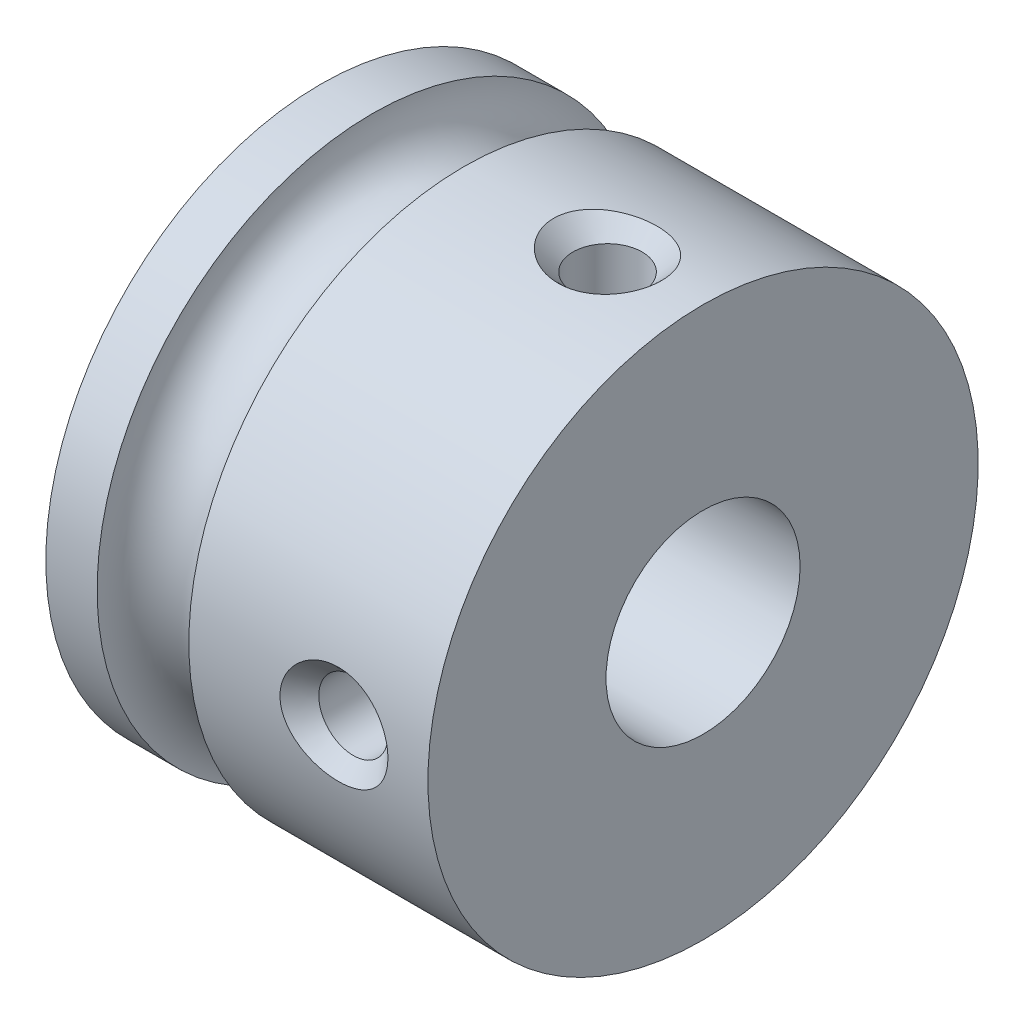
ISO-10303-21;
HEADER;
FILE_DESCRIPTION(('STEP AP214'),'2;1');
FILE_NAME('part.step','',(''),(''),'','','');
FILE_SCHEMA(('AUTOMOTIVE_DESIGN { 1 0 10303 214 1 1 1 1 }'));
ENDSEC;
DATA;
#1=APPLICATION_CONTEXT('core data for automotive mechanical design processes');
#2=APPLICATION_PROTOCOL_DEFINITION('international standard','automotive_design',2000,#1);
#3=PRODUCT_CONTEXT('',#1,'mechanical');
#4=PRODUCT('Part','Part','',(#3));
#5=PRODUCT_RELATED_PRODUCT_CATEGORY('part','',(#4));
#6=PRODUCT_DEFINITION_FORMATION('','',#4);
#7=PRODUCT_DEFINITION_CONTEXT('part definition',#1,'design');
#8=PRODUCT_DEFINITION('design','',#6,#7);
#9=PRODUCT_DEFINITION_SHAPE('','',#8);
#10=(LENGTH_UNIT() NAMED_UNIT(*) SI_UNIT(.MILLI.,.METRE.));
#11=(NAMED_UNIT(*) PLANE_ANGLE_UNIT() SI_UNIT($,.RADIAN.));
#12=(NAMED_UNIT(*) SI_UNIT($,.STERADIAN.) SOLID_ANGLE_UNIT());
#13=UNCERTAINTY_MEASURE_WITH_UNIT(LENGTH_MEASURE(1.E-05),#10,'distance_accuracy_value','');
#14=(GEOMETRIC_REPRESENTATION_CONTEXT(3) GLOBAL_UNCERTAINTY_ASSIGNED_CONTEXT((#13)) GLOBAL_UNIT_ASSIGNED_CONTEXT((#10,
#11,#12)) REPRESENTATION_CONTEXT('',''));
#15=CARTESIAN_POINT('',(0.,0.,0.));
#16=DIRECTION('',(0.,0.,1.));
#17=DIRECTION('',(1.,0.,0.));
#18=AXIS2_PLACEMENT_3D('',#15,#16,#17);
#19=CARTESIAN_POINT('',(-6.25000000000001,9.00000000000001,0.));
#20=DIRECTION('',(1.,0.,0.));
#21=DIRECTION('',(0.,1.,0.));
#22=AXIS2_PLACEMENT_3D('',#19,#20,#21);
#23=PLANE('',#22);
#24=CARTESIAN_POINT('',(-6.25000000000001,0.,0.));
#25=DIRECTION('',(1.,0.,0.));
#26=DIRECTION('',(0.,0.,-1.));
#27=AXIS2_PLACEMENT_3D('',#24,#25,#26);
#28=CIRCLE('',#27,3.175);
#29=CARTESIAN_POINT('',(-6.25000000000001,0.,-3.175));
#30=VERTEX_POINT('',#29);
#31=EDGE_CURVE('E108',#30,#30,#28,.T.);
#32=ORIENTED_EDGE('',*,*,#31,.T.);
#33=EDGE_LOOP('',(#32));
#34=FACE_BOUND('',#33,.T.);
#35=CARTESIAN_POINT('',(-6.25000000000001,0.,0.));
#36=DIRECTION('',(-1.,0.,0.));
#37=DIRECTION('',(0.,-1.,0.));
#38=AXIS2_PLACEMENT_3D('',#35,#36,#37);
#39=CIRCLE('',#38,8.99999999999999);
#40=CARTESIAN_POINT('',(-6.25,-9.,0.));
#41=VERTEX_POINT('',#40);
#42=EDGE_CURVE('E111',#41,#41,#39,.T.);
#43=ORIENTED_EDGE('',*,*,#42,.T.);
#44=EDGE_LOOP('',(#43));
#45=FACE_BOUND('',#44,.T.);
#46=ADVANCED_FACE('F32',(#34,#45),#23,.F.);
#47=CARTESIAN_POINT('',(6.24999999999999,9.00000000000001,0.));
#48=DIRECTION('',(-1.,0.,0.));
#49=DIRECTION('',(0.,-1.,0.));
#50=AXIS2_PLACEMENT_3D('',#47,#48,#49);
#51=PLANE('',#50);
#52=CARTESIAN_POINT('',(6.25000000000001,0.,0.));
#53=DIRECTION('',(1.,0.,0.));
#54=DIRECTION('',(0.,0.,-1.));
#55=AXIS2_PLACEMENT_3D('',#52,#53,#54);
#56=CIRCLE('',#55,3.175);
#57=CARTESIAN_POINT('',(6.25000000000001,0.,-3.175));
#58=VERTEX_POINT('',#57);
#59=EDGE_CURVE('E78',#58,#58,#56,.T.);
#60=ORIENTED_EDGE('',*,*,#59,.F.);
#61=EDGE_LOOP('',(#60));
#62=FACE_BOUND('',#61,.T.);
#63=CARTESIAN_POINT('',(6.24999999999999,0.,0.));
#64=DIRECTION('',(-1.,0.,0.));
#65=DIRECTION('',(0.,-1.,0.));
#66=AXIS2_PLACEMENT_3D('',#63,#64,#65);
#67=CIRCLE('',#66,8.99999999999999);
#68=CARTESIAN_POINT('',(6.24999999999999,-9.,0.));
#69=VERTEX_POINT('',#68);
#70=EDGE_CURVE('E47',#69,#69,#67,.T.);
#71=ORIENTED_EDGE('',*,*,#70,.F.);
#72=EDGE_LOOP('',(#71));
#73=FACE_BOUND('',#72,.T.);
#74=ADVANCED_FACE('F96',(#62,#73),#51,.F.);
#75=CARTESIAN_POINT('',(-27.9821883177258,0.,0.));
#76=DIRECTION('',(-1.,0.,0.));
#77=DIRECTION('',(0.,-1.,0.));
#78=AXIS2_PLACEMENT_3D('',#75,#76,#77);
#79=CYLINDRICAL_SURFACE('',#78,8.99999999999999);
#80=CARTESIAN_POINT('',(1.97285696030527,-1.183727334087,8.92181537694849));
#81=CARTESIAN_POINT('',(1.90953795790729,-1.12965014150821,8.92898979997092));
#82=CARTESIAN_POINT('',(1.85015079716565,-1.07098631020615,8.93627361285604));
#83=CARTESIAN_POINT('',(1.74079627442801,-0.945354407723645,8.95043570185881));
#84=CARTESIAN_POINT('',(1.69083126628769,-0.878384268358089,8.95731387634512));
#85=CARTESIAN_POINT('',(1.59632303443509,-0.728460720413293,8.97082390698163));
#86=CARTESIAN_POINT('',(1.55325107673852,-0.644556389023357,8.97731609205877));
#87=CARTESIAN_POINT('',(1.48316524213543,-0.470137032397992,8.9881357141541));
#88=CARTESIAN_POINT('',(1.45614708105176,-0.379623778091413,8.99246372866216));
#89=CARTESIAN_POINT('',(1.42117367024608,-0.202819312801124,8.99811211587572));
#90=CARTESIAN_POINT('',(1.41180582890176,-0.116813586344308,8.99965489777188));
#91=CARTESIAN_POINT('',(1.40823099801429,0.055502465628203,9.0002406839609));
#92=CARTESIAN_POINT('',(1.41401829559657,0.141812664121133,8.99928463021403));
#93=CARTESIAN_POINT('',(1.4398243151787,0.308043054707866,8.99509350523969));
#94=CARTESIAN_POINT('',(1.45916328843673,0.388073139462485,8.99196735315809));
#95=CARTESIAN_POINT('',(1.51048777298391,0.543857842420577,8.98389158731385));
#96=CARTESIAN_POINT('',(1.54247455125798,0.619612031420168,8.97894179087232));
#97=CARTESIAN_POINT('',(1.6189874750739,0.767256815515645,8.96755090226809));
#98=CARTESIAN_POINT('',(1.66386005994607,0.83896407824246,8.9610696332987));
#99=CARTESIAN_POINT('',(1.7641265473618,0.974503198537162,8.94734560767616));
#100=CARTESIAN_POINT('',(1.81952373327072,1.03833258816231,8.94010261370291));
#101=CARTESIAN_POINT('',(1.94405674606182,1.16184337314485,8.92492608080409));
#102=CARTESIAN_POINT('',(2.01394302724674,1.2207666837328,8.91698423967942));
#103=CARTESIAN_POINT('',(2.1620245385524,1.32713340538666,8.90177568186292));
#104=CARTESIAN_POINT('',(2.24022283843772,1.37457255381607,8.89450921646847));
#105=CARTESIAN_POINT('',(2.40977641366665,1.46073726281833,8.8807835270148));
#106=CARTESIAN_POINT('',(2.5016851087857,1.49839488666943,8.87444353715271));
#107=CARTESIAN_POINT('',(2.69041111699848,1.55875600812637,8.86404085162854));
#108=CARTESIAN_POINT('',(2.78722970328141,1.58145560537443,8.8599787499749));
#109=CARTESIAN_POINT('',(2.98830005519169,1.61229357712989,8.8544212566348));
#110=CARTESIAN_POINT('',(3.09267928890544,1.61963168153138,8.85306708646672));
#111=CARTESIAN_POINT('',(3.30124314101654,1.61724124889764,8.85350383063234));
#112=CARTESIAN_POINT('',(3.405427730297,1.60751033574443,8.85529518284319));
#113=CARTESIAN_POINT('',(3.61221947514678,1.57088576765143,8.86186593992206));
#114=CARTESIAN_POINT('',(3.71478159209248,1.54374434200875,8.86668846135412));
#115=CARTESIAN_POINT('',(3.91373558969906,1.47255635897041,8.87878786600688));
#116=CARTESIAN_POINT('',(4.01012703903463,1.42850862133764,8.88606492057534));
#117=CARTESIAN_POINT('',(4.19228213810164,1.32513128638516,8.90206224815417));
#118=CARTESIAN_POINT('',(4.27818510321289,1.26604424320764,8.91075889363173));
#119=CARTESIAN_POINT('',(4.43802740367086,1.13345566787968,8.92859087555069));
#120=CARTESIAN_POINT('',(4.51197002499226,1.05995810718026,8.93772609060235));
#121=CARTESIAN_POINT('',(4.6409881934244,0.904896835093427,8.95471274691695));
#122=CARTESIAN_POINT('',(4.69690317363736,0.824038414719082,8.96260778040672));
#123=CARTESIAN_POINT('',(4.79279877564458,0.653229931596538,8.97666974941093));
#124=CARTESIAN_POINT('',(4.8327917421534,0.563286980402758,8.98283802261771));
#125=CARTESIAN_POINT('',(4.8918281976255,0.385901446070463,8.99211998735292));
#126=CARTESIAN_POINT('',(4.91247309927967,0.299003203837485,8.99546426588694));
#127=CARTESIAN_POINT('',(4.93785197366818,0.122864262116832,8.99959138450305));
#128=CARTESIAN_POINT('',(4.94259391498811,0.0336247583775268,9.00037550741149));
#129=CARTESIAN_POINT('',(4.93616677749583,-0.137992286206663,8.99932292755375));
#130=CARTESIAN_POINT('',(4.92608496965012,-0.220414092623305,8.99766530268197));
#131=CARTESIAN_POINT('',(4.8924306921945,-0.382369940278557,8.99223884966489));
#132=CARTESIAN_POINT('',(4.86885850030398,-0.461904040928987,8.98847006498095));
#133=CARTESIAN_POINT('',(4.80911210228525,-0.616316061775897,8.97920762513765));
#134=CARTESIAN_POINT('',(4.77288836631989,-0.691174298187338,8.97370719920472));
#135=CARTESIAN_POINT('',(4.68923076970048,-0.834219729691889,8.96154225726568));
#136=CARTESIAN_POINT('',(4.64179409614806,-0.90240524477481,8.95487744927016));
#137=CARTESIAN_POINT('',(4.53364194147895,-1.03523789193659,8.9405286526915));
#138=CARTESIAN_POINT('',(4.47223758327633,-1.09931914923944,8.93280609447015));
#139=CARTESIAN_POINT('',(4.3402836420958,-1.21725684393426,8.91750134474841));
#140=CARTESIAN_POINT('',(4.2697306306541,-1.27110942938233,8.90991920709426));
#141=CARTESIAN_POINT('',(4.11477792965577,-1.37204450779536,8.89496094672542));
#142=CARTESIAN_POINT('',(4.02970545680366,-1.41810676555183,8.88766237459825));
#143=CARTESIAN_POINT('',(3.85329387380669,-1.49638998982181,8.87481798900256));
#144=CARTESIAN_POINT('',(3.76195292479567,-1.52860687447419,8.86927269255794));
#145=CARTESIAN_POINT('',(3.56929591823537,-1.58030710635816,8.86021285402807));
#146=CARTESIAN_POINT('',(3.46771611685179,-1.59883841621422,8.85685182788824));
#147=CARTESIAN_POINT('',(3.26283142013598,-1.61932138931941,8.85312974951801));
#148=CARTESIAN_POINT('',(3.15952610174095,-1.62126892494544,8.85276944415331));
#149=CARTESIAN_POINT('',(2.95130335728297,-1.6083786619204,8.85512079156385));
#150=CARTESIAN_POINT('',(2.84641357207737,-1.59310438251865,8.85791232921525));
#151=CARTESIAN_POINT('',(2.64075506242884,-1.54533255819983,8.86637083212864));
#152=CARTESIAN_POINT('',(2.53998536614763,-1.51283910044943,8.87203711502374));
#153=CARTESIAN_POINT('',(2.35760632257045,-1.43630082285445,8.88472507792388));
#154=CARTESIAN_POINT('',(2.27516770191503,-1.39417841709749,8.89149291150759));
#155=CARTESIAN_POINT('',(2.11783626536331,-1.29781382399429,8.90606809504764));
#156=CARTESIAN_POINT('',(2.04293835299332,-1.24357990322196,8.91387473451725));
#157=CARTESIAN_POINT('',(1.97285696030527,-1.183727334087,8.92181537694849));
#158=B_SPLINE_CURVE_WITH_KNOTS('',3,(#80,#81,#82,#83,#84,#85,#86,#87,#88,#89,#90,#91,#92,#93,
#94,#95,#96,#97,#98,#99,#100,#101,#102,#103,#104,#105,#106,#107,#108,#109,#110,#111,#112,#113,
#114,#115,#116,#117,#118,#119,#120,#121,#122,#123,#124,#125,#126,#127,#128,#129,#130,#131,#132,
#133,#134,#135,#136,#137,#138,#139,#140,#141,#142,#143,#144,#145,#146,#147,#148,#149,#150,#151,
#152,#153,#154,#155,#156,#157),.UNSPECIFIED.,.T.,.F.,(4,2,2,2,2,2,2,2,2,2,2,2,2,2,2,2,2,2,2,2,2,
2,2,2,2,2,2,2,2,2,2,2,2,2,2,2,2,2,4),(0.,0.250487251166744,0.501036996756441,0.783084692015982,
1.06505708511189,1.32330598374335,1.58145754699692,1.82750940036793,2.07358590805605,
2.32702262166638,2.58053853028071,2.85464713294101,3.12885732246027,3.42612195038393,
3.72346406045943,4.03594605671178,4.34847155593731,4.66554639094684,4.98264336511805,
5.29491868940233,5.6071080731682,5.90137519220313,6.19541371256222,6.46212818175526,
6.72870898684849,6.97668621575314,7.22465833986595,7.47361234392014,7.72262886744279,
7.98877159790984,8.25501435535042,8.54480808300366,8.83468718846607,9.14320673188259,
9.45180306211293,9.76839997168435,10.0849217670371,10.3623495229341,10.639588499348),.UNSPECIFIED.);
#159=CARTESIAN_POINT('',(1.97285696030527,-1.183727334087,8.92181537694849));
#160=VERTEX_POINT('',#159);
#161=EDGE_CURVE('E10',#160,#160,#158,.T.);
#162=ORIENTED_EDGE('',*,*,#161,.T.);
#163=EDGE_LOOP('',(#162));
#164=FACE_BOUND('',#163,.T.);
#165=CARTESIAN_POINT('',(1.92285696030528,8.92181537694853,-1.18372733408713));
#166=CARTESIAN_POINT('',(1.98605062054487,8.91465511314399,-1.23769675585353));
#167=CARTESIAN_POINT('',(2.05316931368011,8.90760232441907,-1.28710689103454));
#168=CARTESIAN_POINT('',(2.19371439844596,8.89428052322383,-1.3761555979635));
#169=CARTESIAN_POINT('',(2.26714634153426,8.88801221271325,-1.41578544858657));
#170=CARTESIAN_POINT('',(2.43420360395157,8.87560805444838,-1.49176507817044));
#171=CARTESIAN_POINT('',(2.52890359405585,8.86975699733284,-1.52581886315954));
#172=CARTESIAN_POINT('',(2.72263539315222,8.86054103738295,-1.57845747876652));
#173=CARTESIAN_POINT('',(2.82166906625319,8.85717721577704,-1.59703558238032));
#174=CARTESIAN_POINT('',(3.02565805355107,8.85321753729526,-1.61884975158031));
#175=CARTESIAN_POINT('',(3.13068821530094,8.85274279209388,-1.62141464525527));
#176=CARTESIAN_POINT('',(3.33972738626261,8.85494185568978,-1.60935994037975));
#177=CARTESIAN_POINT('',(3.4437363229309,8.8576158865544,-1.59473912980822));
#178=CARTESIAN_POINT('',(3.64888692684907,8.8658458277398,-1.54833339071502));
#179=CARTESIAN_POINT('',(3.7499876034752,8.87143137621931,-1.51637180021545));
#180=CARTESIAN_POINT('',(3.94516988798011,8.88483485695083,-1.43574768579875));
#181=CARTESIAN_POINT('',(4.03925106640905,8.89265292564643,-1.38708414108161));
#182=CARTESIAN_POINT('',(4.21551919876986,8.90938668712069,-1.27513060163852));
#183=CARTESIAN_POINT('',(4.29790743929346,8.91827712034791,-1.21215471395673));
#184=CARTESIAN_POINT('',(4.44998744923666,8.93616182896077,-1.07236051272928));
#185=CARTESIAN_POINT('',(4.51968379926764,8.94515606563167,-0.99554721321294));
#186=CARTESIAN_POINT('',(4.63937417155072,8.96148932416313,-0.835321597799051));
#187=CARTESIAN_POINT('',(4.69034467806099,8.96889748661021,-0.752647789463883));
#188=CARTESIAN_POINT('',(4.77609661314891,8.98176552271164,-0.579154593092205));
#189=CARTESIAN_POINT('',(4.81089081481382,8.98722693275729,-0.488341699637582));
#190=CARTESIAN_POINT('',(4.85998060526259,8.99504459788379,-0.310398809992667));
#191=CARTESIAN_POINT('',(4.87589552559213,8.99764446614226,-0.223724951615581));
#192=CARTESIAN_POINT('',(4.89209206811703,9.00029084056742,-0.0489006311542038));
#193=CARTESIAN_POINT('',(4.89238029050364,9.00033842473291,0.0392491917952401));
#194=CARTESIAN_POINT('',(4.87778851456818,8.99795342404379,0.208777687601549));
#195=CARTESIAN_POINT('',(4.8638360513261,8.99567249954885,0.290240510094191));
#196=CARTESIAN_POINT('',(4.82279587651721,8.98911286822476,0.449688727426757));
#197=CARTESIAN_POINT('',(4.79570780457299,8.98483410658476,0.527674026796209));
#198=CARTESIAN_POINT('',(4.72901081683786,8.97465059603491,0.679351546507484));
#199=CARTESIAN_POINT('',(4.68922074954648,8.96872249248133,0.752962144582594));
#200=CARTESIAN_POINT('',(4.59871619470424,8.95586274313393,0.893016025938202));
#201=CARTESIAN_POINT('',(4.54799866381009,8.94893081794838,0.959457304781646));
#202=CARTESIAN_POINT('',(4.43308217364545,8.93417326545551,1.0886176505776));
#203=CARTESIAN_POINT('',(4.36815965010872,8.92631954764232,1.15068905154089));
#204=CARTESIAN_POINT('',(4.22949954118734,8.9109682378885,1.26409136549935));
#205=CARTESIAN_POINT('',(4.15575865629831,8.90347078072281,1.31541823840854));
#206=CARTESIAN_POINT('',(3.99463914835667,8.88892076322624,1.41053494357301));
#207=CARTESIAN_POINT('',(3.90663198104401,8.88196411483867,1.45327625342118));
#208=CARTESIAN_POINT('',(3.72488336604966,8.87002680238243,1.52444409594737));
#209=CARTESIAN_POINT('',(3.63114026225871,8.86504671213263,1.55286647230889));
#210=CARTESIAN_POINT('',(3.43466245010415,8.85735409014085,1.59618298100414));
#211=CARTESIAN_POINT('',(3.33172338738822,8.85479244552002,1.61018139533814));
#212=CARTESIAN_POINT('',(3.12490035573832,8.85275160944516,1.62136367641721));
#213=CARTESIAN_POINT('',(3.02101624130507,8.85327290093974,1.61854490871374));
#214=CARTESIAN_POINT('',(2.81295797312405,8.85738301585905,1.59590171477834));
#215=CARTESIAN_POINT('',(2.70882349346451,8.8610359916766,1.57572161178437));
#216=CARTESIAN_POINT('',(2.50550640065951,8.87106474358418,1.5182408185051));
#217=CARTESIAN_POINT('',(2.40632423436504,8.87744076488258,1.48093858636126));
#218=CARTESIAN_POINT('',(2.21677690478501,8.89208318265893,1.39030138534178));
#219=CARTESIAN_POINT('',(2.12634221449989,8.90033255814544,1.33710949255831));
#220=CARTESIAN_POINT('',(1.95633537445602,8.91773926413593,1.21559819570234));
#221=CARTESIAN_POINT('',(1.87676142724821,8.9268964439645,1.14728129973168));
#222=CARTESIAN_POINT('',(1.7350708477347,8.94448890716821,1.00064789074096));
#223=CARTESIAN_POINT('',(1.672301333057,8.95293777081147,0.92296584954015));
#224=CARTESIAN_POINT('',(1.56217935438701,8.96847333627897,0.757219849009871));
#225=CARTESIAN_POINT('',(1.51481581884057,8.97556101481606,0.669163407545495));
#226=CARTESIAN_POINT('',(1.44138463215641,8.98684464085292,0.493613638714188));
#227=CARTESIAN_POINT('',(1.41379465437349,8.99124208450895,0.406770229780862));
#228=CARTESIAN_POINT('',(1.37483561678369,8.99751092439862,0.229441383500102));
#229=CARTESIAN_POINT('',(1.3634564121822,8.99938390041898,0.138958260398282));
#230=CARTESIAN_POINT('',(1.35775653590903,9.00031885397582,-0.0352708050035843));
#231=CARTESIAN_POINT('',(1.36214269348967,8.99959394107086,-0.118975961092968));
#232=CARTESIAN_POINT('',(1.38492668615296,8.9958856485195,-0.28440269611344));
#233=CARTESIAN_POINT('',(1.40332457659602,8.99290225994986,-0.366124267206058));
#234=CARTESIAN_POINT('',(1.45299751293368,8.98505798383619,-0.524350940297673));
#235=CARTESIAN_POINT('',(1.48411632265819,8.98021991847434,-0.600906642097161));
#236=CARTESIAN_POINT('',(1.55798094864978,8.96916327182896,-0.748034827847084));
#237=CARTESIAN_POINT('',(1.60072378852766,8.96294504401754,-0.818608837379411));
#238=CARTESIAN_POINT('',(1.68793737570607,8.95088623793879,-0.940591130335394));
#239=CARTESIAN_POINT('',(1.73078317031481,8.94517146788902,-0.993187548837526));
#240=CARTESIAN_POINT('',(1.82250422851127,8.93355245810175,-1.09277284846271));
#241=CARTESIAN_POINT('',(1.87137826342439,8.92764825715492,-1.13976286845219));
#242=CARTESIAN_POINT('',(1.92285696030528,8.92181537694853,-1.18372733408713));
#243=B_SPLINE_CURVE_WITH_KNOTS('',3,(#165,#166,#167,#168,#169,#170,#171,#172,#173,#174,#175,
#176,#177,#178,#179,#180,#181,#182,#183,#184,#185,#186,#187,#188,#189,#190,#191,#192,#193,#194,
#195,#196,#197,#198,#199,#200,#201,#202,#203,#204,#205,#206,#207,#208,#209,#210,#211,#212,#213,
#214,#215,#216,#217,#218,#219,#220,#221,#222,#223,#224,#225,#226,#227,#228,#229,#230,#231,#232,
#233,#234,#235,#236,#237,#238,#239,#240,#241,#242),.UNSPECIFIED.,.T.,.F.,(4,2,2,2,2,2,2,2,2,2,2,
2,2,2,2,2,2,2,2,2,2,2,2,2,2,2,2,2,2,2,2,2,2,2,2,2,2,2,4),(0.,0.250054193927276,
0.500330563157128,0.801374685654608,1.10254959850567,1.41626752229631,1.7300075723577,
2.04700561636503,2.36402303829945,2.67465971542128,2.98518405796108,3.27580569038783,
3.56619745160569,3.82929439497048,4.09228021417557,4.33916574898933,4.58605805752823,
4.83664180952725,5.08729544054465,5.35665210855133,5.62610987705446,5.91908088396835,
6.21213688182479,6.52245910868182,6.83282994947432,7.14971492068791,7.466628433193,
7.7807702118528,8.0948599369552,8.39392863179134,8.69278192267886,8.96498707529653,
9.23702180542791,9.48727027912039,9.73751974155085,9.98478385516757,10.2319847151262,
10.4357248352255,10.6394234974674),.UNSPECIFIED.);
#244=CARTESIAN_POINT('',(1.92285696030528,8.92181537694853,-1.18372733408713));
#245=VERTEX_POINT('',#244);
#246=EDGE_CURVE('E43',#245,#245,#243,.T.);
#247=ORIENTED_EDGE('',*,*,#246,.T.);
#248=EDGE_LOOP('',(#247));
#249=FACE_BOUND('',#248,.T.);
#250=CARTESIAN_POINT('',(-1.5714609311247,0.,0.));
#251=DIRECTION('',(-1.,0.,0.));
#252=DIRECTION('',(0.,-1.,0.));
#253=AXIS2_PLACEMENT_3D('',#250,#251,#252);
#254=CIRCLE('',#253,8.99999999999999);
#255=CARTESIAN_POINT('',(-1.5714609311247,-9.,0.));
#256=VERTEX_POINT('',#255);
#257=EDGE_CURVE('E115',#256,#256,#254,.T.);
#258=ORIENTED_EDGE('',*,*,#257,.F.);
#259=EDGE_LOOP('',(#258));
#260=FACE_BOUND('',#259,.T.);
#261=ORIENTED_EDGE('',*,*,#70,.T.);
#262=EDGE_LOOP('',(#261));
#263=FACE_BOUND('',#262,.T.);
#264=ADVANCED_FACE('F57',(#164,#249,#260,#263),#79,.T.);
#265=CARTESIAN_POINT('',(-3.0714609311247,0.,0.));
#266=DIRECTION('',(-1.,0.,0.));
#267=DIRECTION('',(0.,-1.,0.));
#268=AXIS2_PLACEMENT_3D('',#265,#266,#267);
#269=TOROIDAL_SURFACE('',#268,8.99999999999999,1.5);
#270=CARTESIAN_POINT('',(-4.5714609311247,0.,0.));
#271=DIRECTION('',(-1.,0.,0.));
#272=DIRECTION('',(0.,-1.,0.));
#273=AXIS2_PLACEMENT_3D('',#270,#271,#272);
#274=CIRCLE('',#273,8.99999999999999);
#275=CARTESIAN_POINT('',(-4.5714609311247,-9.,0.));
#276=VERTEX_POINT('',#275);
#277=EDGE_CURVE('E112',#276,#276,#274,.T.);
#278=ORIENTED_EDGE('',*,*,#277,.F.);
#279=EDGE_LOOP('',(#278));
#280=FACE_BOUND('',#279,.T.);
#281=ORIENTED_EDGE('',*,*,#257,.T.);
#282=EDGE_LOOP('',(#281));
#283=FACE_BOUND('',#282,.T.);
#284=ADVANCED_FACE('F89',(#280,#283),#269,.F.);
#285=CARTESIAN_POINT('',(-27.9821883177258,0.,0.));
#286=DIRECTION('',(-1.,0.,0.));
#287=DIRECTION('',(0.,-1.,0.));
#288=AXIS2_PLACEMENT_3D('',#285,#286,#287);
#289=CYLINDRICAL_SURFACE('',#288,8.99999999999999);
#290=ORIENTED_EDGE('',*,*,#42,.F.);
#291=EDGE_LOOP('',(#290));
#292=FACE_BOUND('',#291,.T.);
#293=ORIENTED_EDGE('',*,*,#277,.T.);
#294=EDGE_LOOP('',(#293));
#295=FACE_BOUND('',#294,.T.);
#296=ADVANCED_FACE('F85',(#292,#295),#289,.T.);
#297=CARTESIAN_POINT('',(6.25000000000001,0.,0.));
#298=DIRECTION('',(1.,0.,0.));
#299=DIRECTION('',(0.,0.,-1.));
#300=AXIS2_PLACEMENT_3D('',#297,#298,#299);
#301=CYLINDRICAL_SURFACE('',#300,3.175);
#302=CARTESIAN_POINT('',(2.04470000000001,0.,3.175));
#303=CARTESIAN_POINT('',(2.04469877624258,-0.0614285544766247,3.17500087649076));
#304=CARTESIAN_POINT('',(2.04972367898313,-0.12284839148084,3.17320130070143));
#305=CARTESIAN_POINT('',(2.06961858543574,-0.24386461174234,3.1662010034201));
#306=CARTESIAN_POINT('',(2.08448828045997,-0.303461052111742,3.16100038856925));
#307=CARTESIAN_POINT('',(2.12348844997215,-0.419068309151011,3.14775949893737));
#308=CARTESIAN_POINT('',(2.14760216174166,-0.47508540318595,3.1397243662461));
#309=CARTESIAN_POINT('',(2.20432504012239,-0.582278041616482,3.12162393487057));
#310=CARTESIAN_POINT('',(2.23693622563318,-0.633452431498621,3.11155815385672));
#311=CARTESIAN_POINT('',(2.31105507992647,-0.731495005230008,3.09000790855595));
#312=CARTESIAN_POINT('',(2.35283431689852,-0.778149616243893,3.07848610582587));
#313=CARTESIAN_POINT('',(2.44352654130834,-0.863958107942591,3.055516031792));
#314=CARTESIAN_POINT('',(2.4924414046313,-0.90311000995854,3.04406778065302));
#315=CARTESIAN_POINT('',(2.59802569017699,-0.974093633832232,3.02211785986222));
#316=CARTESIAN_POINT('',(2.65490051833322,-1.00563502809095,3.01166094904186));
#317=CARTESIAN_POINT('',(2.77357939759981,-1.05861134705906,2.99345244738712));
#318=CARTESIAN_POINT('',(2.83538169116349,-1.08004985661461,2.98569989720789));
#319=CARTESIAN_POINT('',(2.95971494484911,-1.11138819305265,2.97417421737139));
#320=CARTESIAN_POINT('',(3.02213069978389,-1.12169236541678,2.97026214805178));
#321=CARTESIAN_POINT('',(3.14791847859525,-1.13173392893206,2.96645158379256));
#322=CARTESIAN_POINT('',(3.21129014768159,-1.13147514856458,2.96655163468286));
#323=CARTESIAN_POINT('',(3.33361336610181,-1.12070953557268,2.97063328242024));
#324=CARTESIAN_POINT('',(3.39262097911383,-1.11074743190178,2.9744085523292));
#325=CARTESIAN_POINT('',(3.50806464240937,-1.08175290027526,2.98507483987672));
#326=CARTESIAN_POINT('',(3.56450034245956,-1.06271924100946,2.99196628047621));
#327=CARTESIAN_POINT('',(3.67436762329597,-1.01579639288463,3.00822311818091));
#328=CARTESIAN_POINT('',(3.72772847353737,-0.98775662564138,3.01763009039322));
#329=CARTESIAN_POINT('',(3.82915226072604,-0.923722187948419,3.03784253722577));
#330=CARTESIAN_POINT('',(3.8772134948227,-0.887724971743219,3.04864845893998));
#331=CARTESIAN_POINT('',(3.96971122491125,-0.806247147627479,3.07123422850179));
#332=CARTESIAN_POINT('',(4.01375635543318,-0.760326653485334,3.08303358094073));
#333=CARTESIAN_POINT('',(4.09363040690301,-0.661610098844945,3.10571393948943));
#334=CARTESIAN_POINT('',(4.12945830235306,-0.60881318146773,3.11659483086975));
#335=CARTESIAN_POINT('',(4.19225643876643,-0.496923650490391,3.13639217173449));
#336=CARTESIAN_POINT('',(4.2191083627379,-0.437759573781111,3.14528190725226));
#337=CARTESIAN_POINT('',(4.26235200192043,-0.315359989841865,3.15989936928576));
#338=CARTESIAN_POINT('',(4.27874788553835,-0.252126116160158,3.16562835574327));
#339=CARTESIAN_POINT('',(4.2998894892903,-0.126684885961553,3.17306329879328));
#340=CARTESIAN_POINT('',(4.30516304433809,-0.0645771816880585,3.17495136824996));
#341=CARTESIAN_POINT('',(4.30543160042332,0.059656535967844,3.17504672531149));
#342=CARTESIAN_POINT('',(4.30042861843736,0.121782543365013,3.1732547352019));
#343=CARTESIAN_POINT('',(4.28069555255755,0.242087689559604,3.16631168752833));
#344=CARTESIAN_POINT('',(4.2663009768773,0.300329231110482,3.16127656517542));
#345=CARTESIAN_POINT('',(4.22862458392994,0.413538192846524,3.14846933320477));
#346=CARTESIAN_POINT('',(4.20534161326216,0.468505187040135,3.14069686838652));
#347=CARTESIAN_POINT('',(4.14983109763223,0.575332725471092,3.12292068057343));
#348=CARTESIAN_POINT('',(4.11737039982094,0.627062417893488,3.11286035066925));
#349=CARTESIAN_POINT('',(4.04469392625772,0.724505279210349,3.09163517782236));
#350=CARTESIAN_POINT('',(4.00447550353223,0.770216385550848,3.08046995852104));
#351=CARTESIAN_POINT('',(3.91495158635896,0.856811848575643,3.05754963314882));
#352=CARTESIAN_POINT('',(3.86528162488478,0.897320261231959,3.04579412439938));
#353=CARTESIAN_POINT('',(3.75960588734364,0.96948829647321,3.02359841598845));
#354=CARTESIAN_POINT('',(3.70359981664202,1.00114750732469,3.0131582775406));
#355=CARTESIAN_POINT('',(3.58660726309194,1.05465477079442,2.99485112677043));
#356=CARTESIAN_POINT('',(3.52561638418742,1.07649405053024,2.98698641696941));
#357=CARTESIAN_POINT('',(3.40047036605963,1.1094694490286,2.97489781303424));
#358=CARTESIAN_POINT('',(3.33631694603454,1.120611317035,2.97067196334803));
#359=CARTESIAN_POINT('',(3.2106943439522,1.13139068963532,2.96658222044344));
#360=CARTESIAN_POINT('',(3.14928675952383,1.13166111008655,2.96647835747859));
#361=CARTESIAN_POINT('',(3.02735111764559,1.12228164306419,2.97003931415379));
#362=CARTESIAN_POINT('',(2.96682299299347,1.1126325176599,2.97370384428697));
#363=CARTESIAN_POINT('',(2.84987294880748,1.08416089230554,2.98419839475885));
#364=CARTESIAN_POINT('',(2.79338646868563,1.06557142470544,2.99094779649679));
#365=CARTESIAN_POINT('',(2.68429540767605,1.01994372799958,3.0068123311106));
#366=CARTESIAN_POINT('',(2.63169176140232,0.992903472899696,3.01592803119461));
#367=CARTESIAN_POINT('',(2.52909051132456,0.929616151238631,3.03604854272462));
#368=CARTESIAN_POINT('',(2.47934295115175,0.89298623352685,3.04712352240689));
#369=CARTESIAN_POINT('',(2.38649729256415,0.812177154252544,3.06964995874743));
#370=CARTESIAN_POINT('',(2.34340120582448,0.767995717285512,3.08110152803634));
#371=CARTESIAN_POINT('',(2.26303642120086,0.670861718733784,3.10373428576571));
#372=CARTESIAN_POINT('',(2.22613466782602,0.617595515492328,3.11487776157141));
#373=CARTESIAN_POINT('',(2.16183451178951,0.505234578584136,3.13506244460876));
#374=CARTESIAN_POINT('',(2.13443530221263,0.446140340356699,3.14410383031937));
#375=CARTESIAN_POINT('',(2.09006649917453,0.323645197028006,3.15906443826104));
#376=CARTESIAN_POINT('',(2.07311543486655,0.260236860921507,3.16497811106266));
#377=CARTESIAN_POINT('',(2.0504349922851,0.131215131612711,3.17294468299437));
#378=CARTESIAN_POINT('',(2.04470130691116,0.0656025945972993,3.17499906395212));
#379=CARTESIAN_POINT('',(2.04470000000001,0.,3.175));
#380=B_SPLINE_CURVE_WITH_KNOTS('',3,(#302,#303,#304,#305,#306,#307,#308,#309,#310,#311,#312,
#313,#314,#315,#316,#317,#318,#319,#320,#321,#322,#323,#324,#325,#326,#327,#328,#329,#330,#331,
#332,#333,#334,#335,#336,#337,#338,#339,#340,#341,#342,#343,#344,#345,#346,#347,#348,#349,#350,
#351,#352,#353,#354,#355,#356,#357,#358,#359,#360,#361,#362,#363,#364,#365,#366,#367,#368,#369,
#370,#371,#372,#373,#374,#375,#376,#377,#378,#379),.UNSPECIFIED.,.T.,.F.,(4,2,2,2,2,2,2,2,2,2,2,
2,2,2,2,2,2,2,2,2,2,2,2,2,2,2,2,2,2,2,2,2,2,2,2,2,2,2,4),(0.,0.184043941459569,0.36808211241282,
0.551788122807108,0.735537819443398,0.925722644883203,1.11595755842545,1.31258758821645,
1.50914779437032,1.69830149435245,1.88738663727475,2.06643452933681,2.24550673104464,
2.42774410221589,2.61003985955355,2.80329006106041,2.9965643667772,3.19229416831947,
3.38794589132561,3.57408187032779,3.76018131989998,3.93997181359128,4.11978564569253,
4.30465683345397,4.48959121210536,4.6841682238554,4.87875428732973,5.0735138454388,
5.26816867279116,5.45147357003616,5.63476438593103,5.81351722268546,5.99231294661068,
6.17977826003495,6.36730015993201,6.56359488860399,6.75987294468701,6.95649809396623,
7.15304773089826),.UNSPECIFIED.);
#381=CARTESIAN_POINT('',(2.04470000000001,0.,3.175));
#382=VERTEX_POINT('',#381);
#383=EDGE_CURVE('E35',#382,#382,#380,.T.);
#384=ORIENTED_EDGE('',*,*,#383,.T.);
#385=EDGE_LOOP('',(#384));
#386=FACE_BOUND('',#385,.T.);
#387=CARTESIAN_POINT('',(3.125,2.96699290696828,-1.13030000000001));
#388=CARTESIAN_POINT('',(3.06371104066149,2.96699180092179,-1.13030126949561));
#389=CARTESIAN_POINT('',(3.00243087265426,2.96891266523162,-1.12529831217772));
#390=CARTESIAN_POINT('',(2.8817032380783,2.976341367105,-1.10549852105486));
#391=CARTESIAN_POINT('',(2.82225587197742,2.98184940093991,-1.09070115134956));
#392=CARTESIAN_POINT('',(2.70696624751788,2.9957511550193,-1.0519121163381));
#393=CARTESIAN_POINT('',(2.65111641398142,3.00413855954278,-1.02794056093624));
#394=CARTESIAN_POINT('',(2.54421075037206,3.02284430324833,-0.971553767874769));
#395=CARTESIAN_POINT('',(2.49315619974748,3.03316315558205,-0.939136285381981));
#396=CARTESIAN_POINT('',(2.39500779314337,3.05508626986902,-0.865225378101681));
#397=CARTESIAN_POINT('',(2.34815910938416,3.06672572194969,-0.823416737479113));
#398=CARTESIAN_POINT('',(2.26196785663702,3.08968323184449,-0.732580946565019));
#399=CARTESIAN_POINT('',(2.22262669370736,3.10100122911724,-0.683552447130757));
#400=CARTESIAN_POINT('',(2.15141872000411,3.12245376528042,-0.577839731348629));
#401=CARTESIAN_POINT('',(2.11981389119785,3.13254217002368,-0.520968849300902));
#402=CARTESIAN_POINT('',(2.06671944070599,3.14997980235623,-0.402295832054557));
#403=CARTESIAN_POINT('',(2.04522668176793,3.15732987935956,-0.340495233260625));
#404=CARTESIAN_POINT('',(2.01381290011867,3.16821317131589,-0.21629142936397));
#405=CARTESIAN_POINT('',(2.00347077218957,3.17188488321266,-0.154007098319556));
#406=CARTESIAN_POINT('',(1.99330739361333,3.17549223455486,-0.0284859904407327));
#407=CARTESIAN_POINT('',(1.99348305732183,3.17542896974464,0.0347505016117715));
#408=CARTESIAN_POINT('',(2.00409474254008,3.17166431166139,0.157380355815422));
#409=CARTESIAN_POINT('',(2.01407222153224,3.16812551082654,0.21681923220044));
#410=CARTESIAN_POINT('',(2.04323912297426,3.15801637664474,0.333116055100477));
#411=CARTESIAN_POINT('',(2.0624291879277,3.15144583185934,0.389973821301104));
#412=CARTESIAN_POINT('',(2.10971458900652,3.1358170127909,0.500434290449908));
#413=CARTESIAN_POINT('',(2.13793071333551,3.12672523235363,0.553980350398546));
#414=CARTESIAN_POINT('',(2.20236408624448,3.1069864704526,0.655704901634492));
#415=CARTESIAN_POINT('',(2.23858376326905,3.09633901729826,0.703881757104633));
#416=CARTESIAN_POINT('',(2.3202538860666,3.0739295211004,0.796215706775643));
#417=CARTESIAN_POINT('',(2.36609295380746,3.06213831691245,0.840022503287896));
#418=CARTESIAN_POINT('',(2.46455262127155,3.03923485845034,0.919450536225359));
#419=CARTESIAN_POINT('',(2.51717459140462,3.02812274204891,0.955070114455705));
#420=CARTESIAN_POINT('',(2.62895927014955,3.00766281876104,1.01769271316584));
#421=CARTESIAN_POINT('',(2.68822387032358,2.99835093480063,1.04452651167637));
#422=CARTESIAN_POINT('',(2.81084794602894,2.98296002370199,1.08770687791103));
#423=CARTESIAN_POINT('',(2.87420539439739,2.97687940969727,1.10405859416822));
#424=CARTESIAN_POINT('',(2.99978496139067,2.96900658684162,1.12505332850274));
#425=CARTESIAN_POINT('',(3.06190238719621,2.96701300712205,1.1302467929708));
#426=CARTESIAN_POINT('',(3.1861397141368,2.96697312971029,1.1303523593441));
#427=CARTESIAN_POINT('',(3.24825961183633,2.96892597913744,1.12526668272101));
#428=CARTESIAN_POINT('',(3.36806963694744,2.97635611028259,1.10545550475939));
#429=CARTESIAN_POINT('',(3.42583689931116,2.98168526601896,1.09113471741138));
#430=CARTESIAN_POINT('',(3.53812956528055,2.99509779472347,1.05375787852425));
#431=CARTESIAN_POINT('',(3.59265434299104,3.00318169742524,1.03070014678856));
#432=CARTESIAN_POINT('',(3.69902870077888,3.0215413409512,0.975593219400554));
#433=CARTESIAN_POINT('',(3.75071831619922,3.03188377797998,0.943258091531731));
#434=CARTESIAN_POINT('',(3.84813515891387,3.0534751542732,0.870827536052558));
#435=CARTESIAN_POINT('',(3.89386038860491,3.06472439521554,0.830729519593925));
#436=CARTESIAN_POINT('',(3.98070682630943,3.08762481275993,0.741245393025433));
#437=CARTESIAN_POINT('',(4.02142589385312,3.09926313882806,0.691464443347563));
#438=CARTESIAN_POINT('',(4.09397025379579,3.12101743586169,0.585488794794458));
#439=CARTESIAN_POINT('',(4.12579570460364,3.13113343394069,0.529294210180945));
#440=CARTESIAN_POINT('',(4.17939303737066,3.14867455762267,0.412253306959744));
#441=CARTESIAN_POINT('',(4.20121652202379,3.15611345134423,0.3514327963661));
#442=CARTESIAN_POINT('',(4.23421657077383,3.16751726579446,0.226662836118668));
#443=CARTESIAN_POINT('',(4.24539758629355,3.17148363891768,0.162714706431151));
#444=CARTESIAN_POINT('',(4.25635162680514,3.17537085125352,0.0371588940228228));
#445=CARTESIAN_POINT('',(4.25669853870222,3.17549520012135,-0.0243929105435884));
#446=CARTESIAN_POINT('',(4.24742232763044,3.1722011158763,-0.146637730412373));
#447=CARTESIAN_POINT('',(4.23780021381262,3.16878304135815,-0.20733083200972));
#448=CARTESIAN_POINT('',(4.20925332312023,3.15887305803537,-0.324899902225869));
#449=CARTESIAN_POINT('',(4.19052049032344,3.15244466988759,-0.381828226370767));
#450=CARTESIAN_POINT('',(4.14446825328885,3.13717898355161,-0.491747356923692));
#451=CARTESIAN_POINT('',(4.1171472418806,3.1283412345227,-0.544737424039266));
#452=CARTESIAN_POINT('',(4.05344643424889,3.10871467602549,-0.647587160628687));
#453=CARTESIAN_POINT('',(4.01674861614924,3.09786207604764,-0.697237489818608));
#454=CARTESIAN_POINT('',(3.93585525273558,3.0755525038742,-0.789857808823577));
#455=CARTESIAN_POINT('',(3.89165715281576,3.06409532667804,-0.832825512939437));
#456=CARTESIAN_POINT('',(3.79457728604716,3.04122635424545,-0.912898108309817));
#457=CARTESIAN_POINT('',(3.74138813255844,3.02984124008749,-0.949639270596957));
#458=CARTESIAN_POINT('',(3.62922984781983,3.00903053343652,-1.01365584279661));
#459=CARTESIAN_POINT('',(3.57026116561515,2.999604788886,-1.04093198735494));
#460=CARTESIAN_POINT('',(3.44802364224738,2.98390999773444,-1.08510912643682));
#461=CARTESIAN_POINT('',(3.38474775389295,2.97764627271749,-1.10199264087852));
#462=CARTESIAN_POINT('',(3.25597715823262,2.96918932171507,-1.12458464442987));
#463=CARTESIAN_POINT('',(3.19048356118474,2.96699408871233,-1.13029864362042));
#464=CARTESIAN_POINT('',(3.125,2.96699290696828,-1.13030000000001));
#465=B_SPLINE_CURVE_WITH_KNOTS('',3,(#387,#388,#389,#390,#391,#392,#393,#394,#395,#396,#397,
#398,#399,#400,#401,#402,#403,#404,#405,#406,#407,#408,#409,#410,#411,#412,#413,#414,#415,#416,
#417,#418,#419,#420,#421,#422,#423,#424,#425,#426,#427,#428,#429,#430,#431,#432,#433,#434,#435,
#436,#437,#438,#439,#440,#441,#442,#443,#444,#445,#446,#447,#448,#449,#450,#451,#452,#453,#454,
#455,#456,#457,#458,#459,#460,#461,#462,#463,#464),.UNSPECIFIED.,.T.,.F.,(4,2,2,2,2,2,2,2,2,2,2,
2,2,2,2,2,2,2,2,2,2,2,2,2,2,2,2,2,2,2,2,2,2,2,2,2,2,2,4),(0.,0.183623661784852,
0.367257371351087,0.550490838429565,0.733773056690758,0.924501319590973,1.1152652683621,
1.31179756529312,1.50826884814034,1.69702812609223,1.88573202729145,2.06600906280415,
2.24629867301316,2.42910965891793,2.61197618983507,2.80457310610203,2.99720899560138,
3.19336255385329,3.38941969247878,3.57555921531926,3.761658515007,3.94011049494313,
4.11859681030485,4.30331748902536,4.48809987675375,4.68324756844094,4.87839178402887,
5.07251754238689,5.26656206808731,5.45030949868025,5.63403833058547,5.81405386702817,
5.99410311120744,6.18133819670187,6.36863718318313,6.56461137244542,6.76057034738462,
6.95685802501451,7.15304884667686),.UNSPECIFIED.);
#466=CARTESIAN_POINT('',(3.125,2.96699290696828,-1.13030000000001));
#467=VERTEX_POINT('',#466);
#468=EDGE_CURVE('E73',#467,#467,#465,.T.);
#469=ORIENTED_EDGE('',*,*,#468,.T.);
#470=EDGE_LOOP('',(#469));
#471=FACE_BOUND('',#470,.T.);
#472=ORIENTED_EDGE('',*,*,#31,.F.);
#473=EDGE_LOOP('',(#472));
#474=FACE_BOUND('',#473,.T.);
#475=ORIENTED_EDGE('',*,*,#59,.T.);
#476=EDGE_LOOP('',(#475));
#477=FACE_BOUND('',#476,.T.);
#478=ADVANCED_FACE('F81',(#386,#471,#474,#477),#301,.F.);
#479=CARTESIAN_POINT('',(3.125,8.36500000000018,0.));
#480=DIRECTION('',(0.,1.,0.));
#481=DIRECTION('',(0.,0.,1.));
#482=AXIS2_PLACEMENT_3D('',#479,#480,#481);
#483=CONICAL_SURFACE('',#482,1.1303,0.785398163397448);
#484=CARTESIAN_POINT('',(3.125,8.36500000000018,0.));
#485=DIRECTION('',(0.,-1.,0.));
#486=DIRECTION('',(0.,0.,-1.));
#487=AXIS2_PLACEMENT_3D('',#484,#485,#486);
#488=CIRCLE('',#487,1.1303);
#489=CARTESIAN_POINT('',(3.125,8.36500000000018,-1.13030000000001));
#490=VERTEX_POINT('',#489);
#491=EDGE_CURVE('E79',#490,#490,#488,.T.);
#492=ORIENTED_EDGE('',*,*,#491,.T.);
#493=EDGE_LOOP('',(#492));
#494=FACE_BOUND('',#493,.T.);
#495=ORIENTED_EDGE('',*,*,#246,.F.);
#496=EDGE_LOOP('',(#495));
#497=FACE_BOUND('',#496,.T.);
#498=ADVANCED_FACE('F70',(#494,#497),#483,.F.);
#499=CARTESIAN_POINT('',(3.125,0.,0.));
#500=DIRECTION('',(0.,-1.,0.));
#501=DIRECTION('',(0.,0.,-1.));
#502=AXIS2_PLACEMENT_3D('',#499,#500,#501);
#503=CYLINDRICAL_SURFACE('',#502,1.13029999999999);
#504=ORIENTED_EDGE('',*,*,#491,.F.);
#505=EDGE_LOOP('',(#504));
#506=FACE_BOUND('',#505,.T.);
#507=ORIENTED_EDGE('',*,*,#468,.F.);
#508=EDGE_LOOP('',(#507));
#509=FACE_BOUND('',#508,.T.);
#510=ADVANCED_FACE('F65',(#506,#509),#503,.F.);
#511=CARTESIAN_POINT('',(3.175,0.,8.36499999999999));
#512=DIRECTION('',(0.,0.,1.));
#513=DIRECTION('',(1.,0.,0.));
#514=AXIS2_PLACEMENT_3D('',#511,#512,#513);
#515=CONICAL_SURFACE('',#514,1.1303,0.785398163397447);
#516=CARTESIAN_POINT('',(3.175,0.,8.36499999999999));
#517=DIRECTION('',(0.,0.,-1.));
#518=DIRECTION('',(-1.,0.,0.));
#519=AXIS2_PLACEMENT_3D('',#516,#517,#518);
#520=CIRCLE('',#519,1.1303);
#521=CARTESIAN_POINT('',(2.0447,0.,8.36499999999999));
#522=VERTEX_POINT('',#521);
#523=EDGE_CURVE('E130',#522,#522,#520,.T.);
#524=ORIENTED_EDGE('',*,*,#523,.T.);
#525=EDGE_LOOP('',(#524));
#526=FACE_BOUND('',#525,.T.);
#527=ORIENTED_EDGE('',*,*,#161,.F.);
#528=EDGE_LOOP('',(#527));
#529=FACE_BOUND('',#528,.T.);
#530=ADVANCED_FACE('F60',(#526,#529),#515,.F.);
#531=CARTESIAN_POINT('',(3.175,0.,0.));
#532=DIRECTION('',(0.,0.,-1.));
#533=DIRECTION('',(-1.,0.,0.));
#534=AXIS2_PLACEMENT_3D('',#531,#532,#533);
#535=CYLINDRICAL_SURFACE('',#534,1.13029999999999);
#536=ORIENTED_EDGE('',*,*,#523,.F.);
#537=EDGE_LOOP('',(#536));
#538=FACE_BOUND('',#537,.T.);
#539=ORIENTED_EDGE('',*,*,#383,.F.);
#540=EDGE_LOOP('',(#539));
#541=FACE_BOUND('',#540,.T.);
#542=ADVANCED_FACE('F64',(#538,#541),#535,.F.);
#543=CLOSED_SHELL('',(#46,#74,#264,#284,#296,#478,#498,#510,#530,#542));
#544=MANIFOLD_SOLID_BREP('B2',#543);
#545=ADVANCED_BREP_SHAPE_REPRESENTATION('',(#18,#544),#14);
#546=SHAPE_DEFINITION_REPRESENTATION(#9,#545);
ENDSEC;
END-ISO-10303-21;
